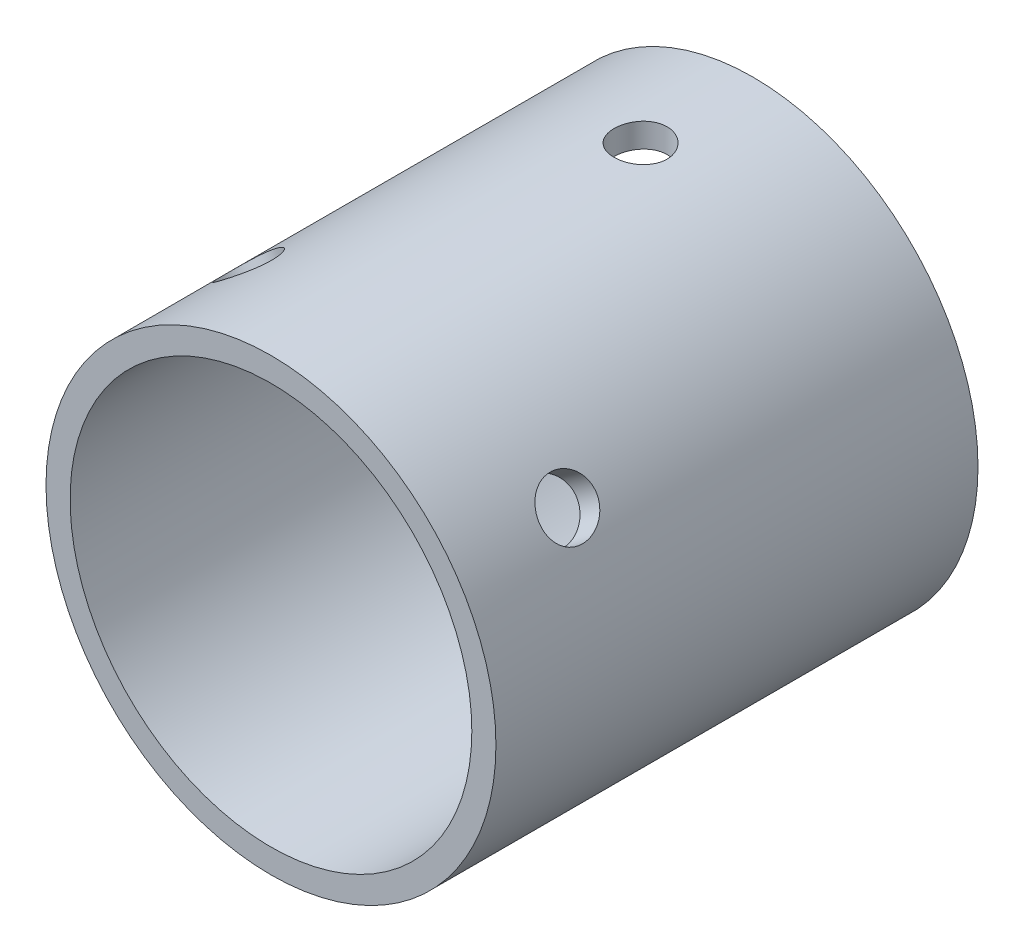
from build123d import *

# Parameters (mm, degrees)
SKETCH1_R          = 14
SKETCH1_R_2        = 12.5
EXTRUDE1_DEPTH     = 30
SKETCH8_R          = 1.65
EXTRUDE2_DEPTH     = 30
SKETCH10_R         = 1.75
CUT_EXTRUDE1_DEPTH = 22
SKETCH11_R         = 1.75
CUT_EXTRUDE2_DEPTH = 21


with BuildPart() as part:
    # Sketch1 → Extrude1 (new body)
    with BuildSketch(Plane.XY):
        Circle(SKETCH1_R)
        Circle(SKETCH1_R_2, mode=Mode.SUBTRACT)
    extrude(amount=EXTRUDE1_DEPTH)

    # Sketch8 → Extrude2 (cut)
    with BuildSketch(Plane(origin=(0, 0, 0), x_dir=(1, 0, 0), z_dir=(0, 1, 0))):
        with Locations(Location((0, -7, 0), (0, 0, 90))):
            Circle(SKETCH8_R)
    extrude(amount=EXTRUDE2_DEPTH, mode=Mode.SUBTRACT)

    # Sketch10 → Cut-Extrude1 (cut)
    with BuildSketch(Plane(origin=(0, 0, 0), x_dir=(0, 0, 1), z_dir=(0.819152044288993, 0.5735764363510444, 0))):
        with Locations(Location((23, 0, 0), (0, 0, 90))):
            Circle(SKETCH10_R)
    extrude(amount=CUT_EXTRUDE1_DEPTH, mode=Mode.SUBTRACT)

    # Sketch11 → Cut-Extrude2 (cut)
    with BuildSketch(Plane(origin=(0, 0, 0), x_dir=(0, 0, 1), z_dir=(-0.6018150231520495, 0.7986355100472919, 0))):
        with Locations(Location((23, 0, 0), (0, 0, 90))):
            Circle(SKETCH11_R)
    extrude(amount=CUT_EXTRUDE2_DEPTH, mode=Mode.SUBTRACT)


solid = part.part
